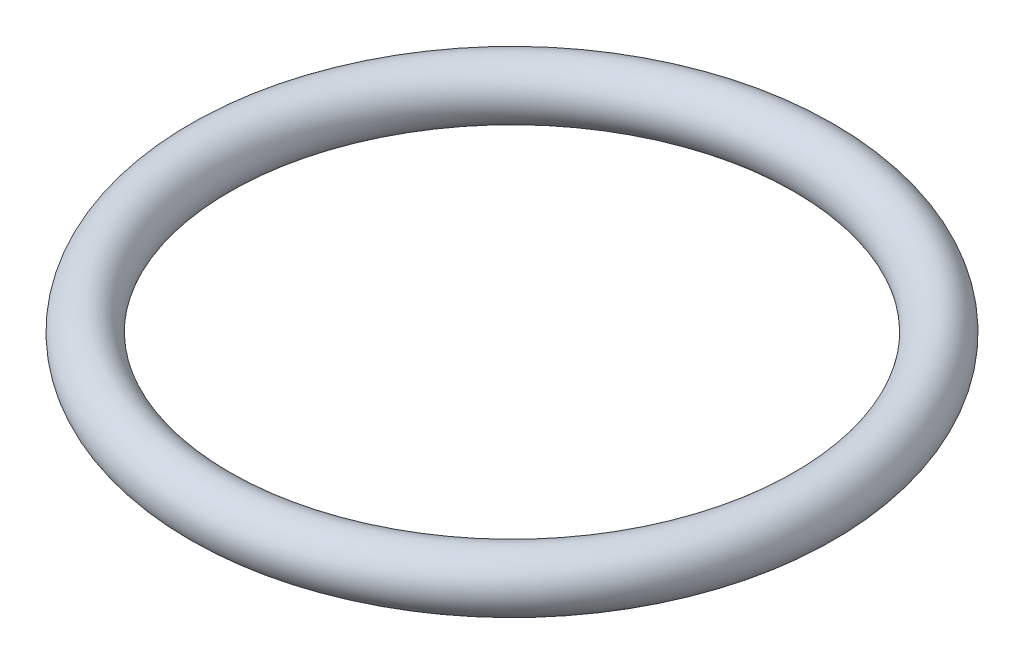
from build123d import *

# Parameters (mm, degrees)
ESQUISSE1_R = 1.8


with BuildPart() as part:
    # Esquisse1 → R_volution1 (revolve)
    with BuildSketch(Plane.XY, mode=Mode.PRIVATE) as r_volution1_sk:
        with Locations((-19.6, 0)):
            Circle(ESQUISSE1_R)
    revolve(r_volution1_sk.sketch.rotate(Axis((0, 0, 0), (0, 1, 0)), 270), axis=Axis((0, 0, 0), (0, 1, 0)))


solid = part.part
